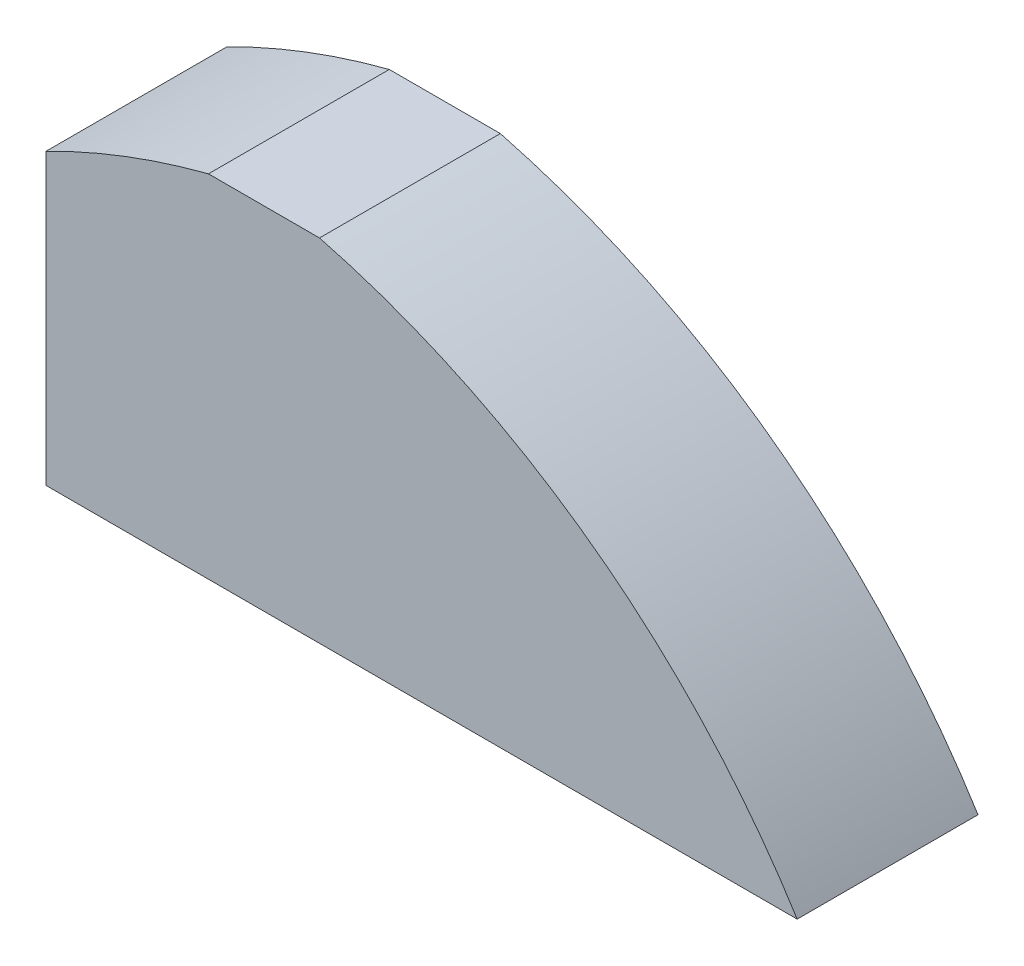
ISO-10303-21;
HEADER;
FILE_DESCRIPTION(('STEP AP214'),'2;1');
FILE_NAME('part.step','',(''),(''),'','','');
FILE_SCHEMA(('AUTOMOTIVE_DESIGN { 1 0 10303 214 1 1 1 1 }'));
ENDSEC;
DATA;
#1=APPLICATION_CONTEXT('core data for automotive mechanical design processes');
#2=APPLICATION_PROTOCOL_DEFINITION('international standard','automotive_design',2000,#1);
#3=PRODUCT_CONTEXT('',#1,'mechanical');
#4=PRODUCT('Part','Part','',(#3));
#5=PRODUCT_RELATED_PRODUCT_CATEGORY('part','',(#4));
#6=PRODUCT_DEFINITION_FORMATION('','',#4);
#7=PRODUCT_DEFINITION_CONTEXT('part definition',#1,'design');
#8=PRODUCT_DEFINITION('design','',#6,#7);
#9=PRODUCT_DEFINITION_SHAPE('','',#8);
#10=(LENGTH_UNIT() NAMED_UNIT(*) SI_UNIT(.MILLI.,.METRE.));
#11=(NAMED_UNIT(*) PLANE_ANGLE_UNIT() SI_UNIT($,.RADIAN.));
#12=(NAMED_UNIT(*) SI_UNIT($,.STERADIAN.) SOLID_ANGLE_UNIT());
#13=UNCERTAINTY_MEASURE_WITH_UNIT(LENGTH_MEASURE(1.E-05),#10,'distance_accuracy_value','');
#14=(GEOMETRIC_REPRESENTATION_CONTEXT(3) GLOBAL_UNCERTAINTY_ASSIGNED_CONTEXT((#13)) GLOBAL_UNIT_ASSIGNED_CONTEXT((#10,
#11,#12)) REPRESENTATION_CONTEXT('',''));
#15=CARTESIAN_POINT('',(0.,0.,0.));
#16=DIRECTION('',(0.,0.,1.));
#17=DIRECTION('',(1.,0.,0.));
#18=AXIS2_PLACEMENT_3D('',#15,#16,#17);
#19=CARTESIAN_POINT('',(0.,358.201119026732,500.));
#20=DIRECTION('',(0.,1.,0.));
#21=DIRECTION('',(0.,0.,1.));
#22=AXIS2_PLACEMENT_3D('',#19,#20,#21);
#23=PLANE('',#22);
#24=DIRECTION('',(1.,0.,0.));
#25=VECTOR('',#24,1.);
#26=CARTESIAN_POINT('',(0.,358.201119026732,0.));
#27=LINE('',#26,#25);
#28=CARTESIAN_POINT('',(-1262.01747886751,358.201119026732,0.));
#29=VERTEX_POINT('',#28);
#30=CARTESIAN_POINT('',(877.522557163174,358.201119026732,0.));
#31=VERTEX_POINT('',#30);
#32=EDGE_CURVE('E185',#29,#31,#27,.T.);
#33=ORIENTED_EDGE('',*,*,#32,.T.);
#34=DIRECTION('',(0.,0.,-1.));
#35=VECTOR('',#34,1.);
#36=CARTESIAN_POINT('',(877.522557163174,358.201119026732,500.));
#37=LINE('',#36,#35);
#38=CARTESIAN_POINT('',(877.522557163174,358.201119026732,515.));
#39=VERTEX_POINT('',#38);
#40=EDGE_CURVE('E11',#39,#31,#37,.T.);
#41=ORIENTED_EDGE('',*,*,#40,.F.);
#42=DIRECTION('',(1.,0.,0.));
#43=VECTOR('',#42,1.);
#44=CARTESIAN_POINT('',(-1262.01747886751,358.201119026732,515.));
#45=LINE('',#44,#43);
#46=CARTESIAN_POINT('',(-1262.01747886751,358.201119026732,515.));
#47=VERTEX_POINT('',#46);
#48=EDGE_CURVE('E251',#47,#39,#45,.T.);
#49=ORIENTED_EDGE('',*,*,#48,.F.);
#50=DIRECTION('',(0.,0.,-1.));
#51=VECTOR('',#50,1.);
#52=CARTESIAN_POINT('',(-1262.01747886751,358.201119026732,500.));
#53=LINE('',#52,#51);
#54=EDGE_CURVE('E108',#47,#29,#53,.T.);
#55=ORIENTED_EDGE('',*,*,#54,.T.);
#56=EDGE_LOOP('',(#33,#41,#49,#55));
#57=FACE_BOUND('',#56,.T.);
#58=ADVANCED_FACE('F32',(#57),#23,.F.);
#59=CARTESIAN_POINT('',(-1054.68362564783,-845.082221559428,500.));
#60=DIRECTION('',(0.,0.,-1.));
#61=DIRECTION('',(-1.,0.,0.));
#62=AXIS2_PLACEMENT_3D('',#59,#60,#61);
#63=CYLINDRICAL_SURFACE('',#62,2276.24944384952);
#64=CARTESIAN_POINT('',(-1054.68362564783,-845.082221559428,0.));
#65=DIRECTION('',(0.,0.,1.));
#66=DIRECTION('',(1.,0.,0.));
#67=AXIS2_PLACEMENT_3D('',#64,#65,#66);
#68=CIRCLE('',#67,2276.24944384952);
#69=CARTESIAN_POINT('',(-482.972114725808,1358.20111902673,0.));
#70=VERTEX_POINT('',#69);
#71=EDGE_CURVE('E187',#31,#70,#68,.T.);
#72=ORIENTED_EDGE('',*,*,#71,.T.);
#73=DIRECTION('',(0.,0.,-1.));
#74=VECTOR('',#73,1.);
#75=CARTESIAN_POINT('',(-482.972114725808,1358.20111902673,500.));
#76=LINE('',#75,#74);
#77=CARTESIAN_POINT('',(-482.972114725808,1358.20111902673,515.));
#78=VERTEX_POINT('',#77);
#79=EDGE_CURVE('E42',#78,#70,#76,.T.);
#80=ORIENTED_EDGE('',*,*,#79,.F.);
#81=CARTESIAN_POINT('',(-1054.68362564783,-845.082221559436,515.));
#82=DIRECTION('',(0.,0.,1.));
#83=DIRECTION('',(-1.,0.,0.));
#84=AXIS2_PLACEMENT_3D('',#81,#82,#83);
#85=CIRCLE('',#84,2276.24944384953);
#86=EDGE_CURVE('E248',#39,#78,#85,.T.);
#87=ORIENTED_EDGE('',*,*,#86,.F.);
#88=ORIENTED_EDGE('',*,*,#40,.T.);
#89=EDGE_LOOP('',(#72,#80,#87,#88));
#90=FACE_BOUND('',#89,.T.);
#91=ADVANCED_FACE('F285',(#90),#63,.T.);
#92=CARTESIAN_POINT('',(0.,1358.20111902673,500.));
#93=DIRECTION('',(0.,1.,0.));
#94=DIRECTION('',(0.,0.,1.));
#95=AXIS2_PLACEMENT_3D('',#92,#93,#94);
#96=PLANE('',#95);
#97=DIRECTION('',(1.,0.,0.));
#98=VECTOR('',#97,1.);
#99=CARTESIAN_POINT('',(0.,1358.20111902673,0.));
#100=LINE('',#99,#98);
#101=CARTESIAN_POINT('',(-799.271194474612,1358.20111902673,0.));
#102=VERTEX_POINT('',#101);
#103=EDGE_CURVE('E190',#102,#70,#100,.T.);
#104=ORIENTED_EDGE('',*,*,#103,.F.);
#105=DIRECTION('',(0.,0.,-1.));
#106=VECTOR('',#105,1.);
#107=CARTESIAN_POINT('',(-799.271194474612,1358.20111902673,500.));
#108=LINE('',#107,#106);
#109=CARTESIAN_POINT('',(-799.271194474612,1358.20111902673,515.));
#110=VERTEX_POINT('',#109);
#111=EDGE_CURVE('E202',#110,#102,#108,.T.);
#112=ORIENTED_EDGE('',*,*,#111,.F.);
#113=DIRECTION('',(-1.,0.,0.));
#114=VECTOR('',#113,1.);
#115=CARTESIAN_POINT('',(-799.271194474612,1358.20111902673,515.));
#116=LINE('',#115,#114);
#117=EDGE_CURVE('E166',#78,#110,#116,.T.);
#118=ORIENTED_EDGE('',*,*,#117,.F.);
#119=ORIENTED_EDGE('',*,*,#79,.T.);
#120=EDGE_LOOP('',(#104,#112,#118,#119));
#121=FACE_BOUND('',#120,.T.);
#122=ADVANCED_FACE('F286',(#121),#96,.T.);
#123=CARTESIAN_POINT('',(-227.559683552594,-845.082221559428,500.));
#124=DIRECTION('',(0.,0.,-1.));
#125=DIRECTION('',(-1.,0.,0.));
#126=AXIS2_PLACEMENT_3D('',#123,#124,#125);
#127=CYLINDRICAL_SURFACE('',#126,2276.24944384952);
#128=CARTESIAN_POINT('',(-227.559683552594,-845.082221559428,0.));
#129=DIRECTION('',(0.,0.,1.));
#130=DIRECTION('',(1.,0.,0.));
#131=AXIS2_PLACEMENT_3D('',#128,#129,#130);
#132=CIRCLE('',#131,2276.24944384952);
#133=CARTESIAN_POINT('',(-1262.01747886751,1182.52932909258,0.));
#134=VERTEX_POINT('',#133);
#135=EDGE_CURVE('E193',#134,#102,#132,.F.);
#136=ORIENTED_EDGE('',*,*,#135,.F.);
#137=DIRECTION('',(0.,0.,-1.));
#138=VECTOR('',#137,1.);
#139=CARTESIAN_POINT('',(-1262.01747886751,1182.52932909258,500.));
#140=LINE('',#139,#138);
#141=CARTESIAN_POINT('',(-1262.01747886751,1182.52932909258,515.));
#142=VERTEX_POINT('',#141);
#143=EDGE_CURVE('E100',#142,#134,#140,.T.);
#144=ORIENTED_EDGE('',*,*,#143,.F.);
#145=CARTESIAN_POINT('',(-227.559683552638,-845.082221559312,515.));
#146=DIRECTION('',(0.,0.,1.));
#147=DIRECTION('',(-1.,0.,0.));
#148=AXIS2_PLACEMENT_3D('',#145,#146,#147);
#149=CIRCLE('',#148,2276.2494438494);
#150=EDGE_CURVE('E257',#110,#142,#149,.T.);
#151=ORIENTED_EDGE('',*,*,#150,.F.);
#152=ORIENTED_EDGE('',*,*,#111,.T.);
#153=EDGE_LOOP('',(#136,#144,#151,#152));
#154=FACE_BOUND('',#153,.T.);
#155=ADVANCED_FACE('F268',(#154),#127,.T.);
#156=CARTESIAN_POINT('',(-1054.68362564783,-845.082221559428,500.));
#157=DIRECTION('',(0.,0.,-1.));
#158=DIRECTION('',(-1.,0.,0.));
#159=AXIS2_PLACEMENT_3D('',#156,#157,#158);
#160=CYLINDRICAL_SURFACE('',#159,2246.24944384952);
#161=CARTESIAN_POINT('',(-1054.68362564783,-845.082221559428,0.));
#162=DIRECTION('',(0.,0.,1.));
#163=DIRECTION('',(1.,0.,0.));
#164=AXIS2_PLACEMENT_3D('',#161,#162,#163);
#165=CIRCLE('',#164,2246.24944384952);
#166=CARTESIAN_POINT('',(822.721169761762,388.201119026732,0.));
#167=VERTEX_POINT('',#166);
#168=CARTESIAN_POINT('',(426.982978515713,843.201119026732,0.));
#169=VERTEX_POINT('',#168);
#170=EDGE_CURVE('E137',#167,#169,#165,.T.);
#171=ORIENTED_EDGE('',*,*,#170,.F.);
#172=DIRECTION('',(0.,0.,-1.));
#173=VECTOR('',#172,1.);
#174=CARTESIAN_POINT('',(822.721169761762,388.201119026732,500.));
#175=LINE('',#174,#173);
#176=CARTESIAN_POINT('',(822.721169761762,388.201119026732,500.));
#177=VERTEX_POINT('',#176);
#178=EDGE_CURVE('E131',#177,#167,#175,.T.);
#179=ORIENTED_EDGE('',*,*,#178,.F.);
#180=CARTESIAN_POINT('',(-1054.68362564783,-845.082221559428,500.));
#181=DIRECTION('',(0.,0.,1.));
#182=DIRECTION('',(1.,0.,0.));
#183=AXIS2_PLACEMENT_3D('',#180,#181,#182);
#184=CIRCLE('',#183,2246.24944384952);
#185=CARTESIAN_POINT('',(426.982978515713,843.201119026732,500.));
#186=VERTEX_POINT('',#185);
#187=EDGE_CURVE('E135',#177,#186,#184,.T.);
#188=ORIENTED_EDGE('',*,*,#187,.T.);
#189=DIRECTION('',(0.,0.,-1.));
#190=VECTOR('',#189,1.);
#191=CARTESIAN_POINT('',(426.982978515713,843.201119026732,500.));
#192=LINE('',#191,#190);
#193=EDGE_CURVE('E205',#186,#169,#192,.T.);
#194=ORIENTED_EDGE('',*,*,#193,.T.);
#195=EDGE_LOOP('',(#171,#179,#188,#194));
#196=FACE_BOUND('',#195,.T.);
#197=ADVANCED_FACE('F133',(#196),#160,.F.);
#198=CARTESIAN_POINT('',(0.,388.201119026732,500.));
#199=DIRECTION('',(0.,1.,0.));
#200=DIRECTION('',(0.,0.,1.));
#201=AXIS2_PLACEMENT_3D('',#198,#199,#200);
#202=PLANE('',#201);
#203=DIRECTION('',(1.,0.,0.));
#204=VECTOR('',#203,1.);
#205=CARTESIAN_POINT('',(0.,388.201119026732,0.));
#206=LINE('',#205,#204);
#207=CARTESIAN_POINT('',(-1232.01747886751,388.201119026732,0.));
#208=VERTEX_POINT('',#207);
#209=EDGE_CURVE('E177',#208,#167,#206,.T.);
#210=ORIENTED_EDGE('',*,*,#209,.F.);
#211=DIRECTION('',(0.,0.,-1.));
#212=VECTOR('',#211,1.);
#213=CARTESIAN_POINT('',(-1232.01747886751,388.201119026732,500.));
#214=LINE('',#213,#212);
#215=CARTESIAN_POINT('',(-1232.01747886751,388.201119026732,500.));
#216=VERTEX_POINT('',#215);
#217=EDGE_CURVE('E141',#216,#208,#214,.T.);
#218=ORIENTED_EDGE('',*,*,#217,.F.);
#219=DIRECTION('',(1.,0.,0.));
#220=VECTOR('',#219,1.);
#221=CARTESIAN_POINT('',(0.,388.201119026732,500.));
#222=LINE('',#221,#220);
#223=EDGE_CURVE('E144',#216,#177,#222,.T.);
#224=ORIENTED_EDGE('',*,*,#223,.T.);
#225=ORIENTED_EDGE('',*,*,#178,.T.);
#226=EDGE_LOOP('',(#210,#218,#224,#225));
#227=FACE_BOUND('',#226,.T.);
#228=ADVANCED_FACE('F145',(#227),#202,.T.);
#229=CARTESIAN_POINT('',(-1232.01747886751,0.,500.));
#230=DIRECTION('',(-1.,0.,0.));
#231=DIRECTION('',(0.,0.,1.));
#232=AXIS2_PLACEMENT_3D('',#229,#230,#231);
#233=PLANE('',#232);
#234=DIRECTION('',(0.,1.,0.));
#235=VECTOR('',#234,1.);
#236=CARTESIAN_POINT('',(-1232.01747886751,0.,0.));
#237=LINE('',#236,#235);
#238=CARTESIAN_POINT('',(-1232.01747886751,843.201119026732,0.));
#239=VERTEX_POINT('',#238);
#240=EDGE_CURVE('E179',#208,#239,#237,.T.);
#241=ORIENTED_EDGE('',*,*,#240,.T.);
#242=DIRECTION('',(0.,0.,-1.));
#243=VECTOR('',#242,1.);
#244=CARTESIAN_POINT('',(-1232.01747886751,843.201119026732,500.));
#245=LINE('',#244,#243);
#246=CARTESIAN_POINT('',(-1232.01747886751,843.201119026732,500.));
#247=VERTEX_POINT('',#246);
#248=EDGE_CURVE('E207',#247,#239,#245,.T.);
#249=ORIENTED_EDGE('',*,*,#248,.F.);
#250=DIRECTION('',(0.,1.,0.));
#251=VECTOR('',#250,1.);
#252=CARTESIAN_POINT('',(-1232.01747886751,0.,500.));
#253=LINE('',#252,#251);
#254=EDGE_CURVE('E149',#216,#247,#253,.T.);
#255=ORIENTED_EDGE('',*,*,#254,.F.);
#256=ORIENTED_EDGE('',*,*,#217,.T.);
#257=EDGE_LOOP('',(#241,#249,#255,#256));
#258=FACE_BOUND('',#257,.T.);
#259=ADVANCED_FACE('F304',(#258),#233,.F.);
#260=CARTESIAN_POINT('',(-1054.68362564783,-845.082221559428,500.));
#261=DIRECTION('',(0.,0.,-1.));
#262=DIRECTION('',(-1.,0.,0.));
#263=AXIS2_PLACEMENT_3D('',#260,#261,#262);
#264=CYLINDRICAL_SURFACE('',#263,2246.24944384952);
#265=CARTESIAN_POINT('',(-1054.68362564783,-845.082221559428,0.));
#266=DIRECTION('',(0.,0.,1.));
#267=DIRECTION('',(1.,0.,0.));
#268=AXIS2_PLACEMENT_3D('',#265,#266,#267);
#269=CIRCLE('',#268,2246.24944384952);
#270=CARTESIAN_POINT('',(392.084816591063,873.201119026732,0.));
#271=VERTEX_POINT('',#270);
#272=CARTESIAN_POINT('',(-486.813846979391,1328.20111902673,0.));
#273=VERTEX_POINT('',#272);
#274=EDGE_CURVE('E162',#271,#273,#269,.T.);
#275=ORIENTED_EDGE('',*,*,#274,.F.);
#276=DIRECTION('',(0.,0.,-1.));
#277=VECTOR('',#276,1.);
#278=CARTESIAN_POINT('',(392.084816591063,873.201119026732,500.));
#279=LINE('',#278,#277);
#280=CARTESIAN_POINT('',(392.084816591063,873.201119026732,500.));
#281=VERTEX_POINT('',#280);
#282=EDGE_CURVE('E36',#281,#271,#279,.T.);
#283=ORIENTED_EDGE('',*,*,#282,.F.);
#284=CARTESIAN_POINT('',(-1054.68362564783,-845.082221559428,500.));
#285=DIRECTION('',(0.,0.,1.));
#286=DIRECTION('',(1.,0.,0.));
#287=AXIS2_PLACEMENT_3D('',#284,#285,#286);
#288=CIRCLE('',#287,2246.24944384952);
#289=CARTESIAN_POINT('',(-486.813846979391,1328.20111902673,500.));
#290=VERTEX_POINT('',#289);
#291=EDGE_CURVE('E199',#281,#290,#288,.T.);
#292=ORIENTED_EDGE('',*,*,#291,.T.);
#293=DIRECTION('',(0.,0.,-1.));
#294=VECTOR('',#293,1.);
#295=CARTESIAN_POINT('',(-486.813846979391,1328.20111902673,500.));
#296=LINE('',#295,#294);
#297=EDGE_CURVE('E161',#290,#273,#296,.T.);
#298=ORIENTED_EDGE('',*,*,#297,.T.);
#299=EDGE_LOOP('',(#275,#283,#292,#298));
#300=FACE_BOUND('',#299,.T.);
#301=ADVANCED_FACE('F34',(#300),#264,.F.);
#302=CARTESIAN_POINT('',(0.,873.201119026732,500.));
#303=DIRECTION('',(0.,1.,0.));
#304=DIRECTION('',(0.,0.,1.));
#305=AXIS2_PLACEMENT_3D('',#302,#303,#304);
#306=PLANE('',#305);
#307=DIRECTION('',(1.,0.,0.));
#308=VECTOR('',#307,1.);
#309=CARTESIAN_POINT('',(0.,873.201119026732,0.));
#310=LINE('',#309,#308);
#311=CARTESIAN_POINT('',(-1232.01747886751,873.201119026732,0.));
#312=VERTEX_POINT('',#311);
#313=EDGE_CURVE('E165',#312,#271,#310,.T.);
#314=ORIENTED_EDGE('',*,*,#313,.F.);
#315=DIRECTION('',(0.,0.,-1.));
#316=VECTOR('',#315,1.);
#317=CARTESIAN_POINT('',(-1232.01747886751,873.201119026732,500.));
#318=LINE('',#317,#316);
#319=CARTESIAN_POINT('',(-1232.01747886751,873.201119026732,500.));
#320=VERTEX_POINT('',#319);
#321=EDGE_CURVE('E216',#320,#312,#318,.T.);
#322=ORIENTED_EDGE('',*,*,#321,.F.);
#323=DIRECTION('',(1.,0.,0.));
#324=VECTOR('',#323,1.);
#325=CARTESIAN_POINT('',(0.,873.201119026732,500.));
#326=LINE('',#325,#324);
#327=EDGE_CURVE('E224',#320,#281,#326,.T.);
#328=ORIENTED_EDGE('',*,*,#327,.T.);
#329=ORIENTED_EDGE('',*,*,#282,.T.);
#330=EDGE_LOOP('',(#314,#322,#328,#329));
#331=FACE_BOUND('',#330,.T.);
#332=ADVANCED_FACE('F222',(#331),#306,.T.);
#333=CARTESIAN_POINT('',(-1232.01747886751,0.,500.));
#334=DIRECTION('',(-1.,0.,0.));
#335=DIRECTION('',(0.,0.,1.));
#336=AXIS2_PLACEMENT_3D('',#333,#334,#335);
#337=PLANE('',#336);
#338=DIRECTION('',(0.,1.,0.));
#339=VECTOR('',#338,1.);
#340=CARTESIAN_POINT('',(-1232.01747886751,0.,0.));
#341=LINE('',#340,#339);
#342=CARTESIAN_POINT('',(-1232.01747886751,1164.07210338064,0.));
#343=VERTEX_POINT('',#342);
#344=EDGE_CURVE('E169',#312,#343,#341,.T.);
#345=ORIENTED_EDGE('',*,*,#344,.T.);
#346=DIRECTION('',(0.,0.,-1.));
#347=VECTOR('',#346,1.);
#348=CARTESIAN_POINT('',(-1232.01747886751,1164.07210338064,500.));
#349=LINE('',#348,#347);
#350=CARTESIAN_POINT('',(-1232.01747886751,1164.07210338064,500.));
#351=VERTEX_POINT('',#350);
#352=EDGE_CURVE('E214',#351,#343,#349,.T.);
#353=ORIENTED_EDGE('',*,*,#352,.F.);
#354=DIRECTION('',(0.,1.,0.));
#355=VECTOR('',#354,1.);
#356=CARTESIAN_POINT('',(-1232.01747886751,0.,500.));
#357=LINE('',#356,#355);
#358=EDGE_CURVE('E240',#320,#351,#357,.T.);
#359=ORIENTED_EDGE('',*,*,#358,.F.);
#360=ORIENTED_EDGE('',*,*,#321,.T.);
#361=EDGE_LOOP('',(#345,#353,#359,#360));
#362=FACE_BOUND('',#361,.T.);
#363=ADVANCED_FACE('F232',(#362),#337,.F.);
#364=CARTESIAN_POINT('',(-227.559683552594,-845.082221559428,500.));
#365=DIRECTION('',(0.,0.,-1.));
#366=DIRECTION('',(-1.,0.,0.));
#367=AXIS2_PLACEMENT_3D('',#364,#365,#366);
#368=CYLINDRICAL_SURFACE('',#367,2246.24944384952);
#369=CARTESIAN_POINT('',(-227.559683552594,-845.082221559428,0.));
#370=DIRECTION('',(0.,0.,1.));
#371=DIRECTION('',(1.,0.,0.));
#372=AXIS2_PLACEMENT_3D('',#369,#370,#371);
#373=CIRCLE('',#372,2246.24944384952);
#374=CARTESIAN_POINT('',(-795.429462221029,1328.20111902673,0.));
#375=VERTEX_POINT('',#374);
#376=EDGE_CURVE('E171',#343,#375,#373,.F.);
#377=ORIENTED_EDGE('',*,*,#376,.T.);
#378=DIRECTION('',(0.,0.,-1.));
#379=VECTOR('',#378,1.);
#380=CARTESIAN_POINT('',(-795.429462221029,1328.20111902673,500.));
#381=LINE('',#380,#379);
#382=CARTESIAN_POINT('',(-795.429462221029,1328.20111902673,500.));
#383=VERTEX_POINT('',#382);
#384=EDGE_CURVE('E211',#383,#375,#381,.T.);
#385=ORIENTED_EDGE('',*,*,#384,.F.);
#386=CARTESIAN_POINT('',(-227.559683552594,-845.082221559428,500.));
#387=DIRECTION('',(0.,0.,1.));
#388=DIRECTION('',(1.,0.,0.));
#389=AXIS2_PLACEMENT_3D('',#386,#387,#388);
#390=CIRCLE('',#389,2246.24944384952);
#391=EDGE_CURVE('E155',#351,#383,#390,.F.);
#392=ORIENTED_EDGE('',*,*,#391,.F.);
#393=ORIENTED_EDGE('',*,*,#352,.T.);
#394=EDGE_LOOP('',(#377,#385,#392,#393));
#395=FACE_BOUND('',#394,.T.);
#396=ADVANCED_FACE('F235',(#395),#368,.F.);
#397=CARTESIAN_POINT('',(0.,843.201119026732,500.));
#398=DIRECTION('',(0.,1.,0.));
#399=DIRECTION('',(-1.,0.,0.));
#400=AXIS2_PLACEMENT_3D('',#397,#398,#399);
#401=PLANE('',#400);
#402=DIRECTION('',(1.,0.,0.));
#403=VECTOR('',#402,1.);
#404=CARTESIAN_POINT('',(0.,843.201119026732,0.));
#405=LINE('',#404,#403);
#406=EDGE_CURVE('E182',#239,#169,#405,.T.);
#407=ORIENTED_EDGE('',*,*,#406,.T.);
#408=ORIENTED_EDGE('',*,*,#193,.F.);
#409=DIRECTION('',(1.,0.,0.));
#410=VECTOR('',#409,1.);
#411=CARTESIAN_POINT('',(0.,843.201119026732,500.));
#412=LINE('',#411,#410);
#413=EDGE_CURVE('E51',#247,#186,#412,.T.);
#414=ORIENTED_EDGE('',*,*,#413,.F.);
#415=ORIENTED_EDGE('',*,*,#248,.T.);
#416=EDGE_LOOP('',(#407,#408,#414,#415));
#417=FACE_BOUND('',#416,.T.);
#418=ADVANCED_FACE('F300',(#417),#401,.F.);
#419=CARTESIAN_POINT('',(0.,1328.20111902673,500.));
#420=DIRECTION('',(0.,1.,0.));
#421=DIRECTION('',(0.,0.,1.));
#422=AXIS2_PLACEMENT_3D('',#419,#420,#421);
#423=PLANE('',#422);
#424=DIRECTION('',(1.,0.,0.));
#425=VECTOR('',#424,1.);
#426=CARTESIAN_POINT('',(0.,1328.20111902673,0.));
#427=LINE('',#426,#425);
#428=EDGE_CURVE('E173',#375,#273,#427,.T.);
#429=ORIENTED_EDGE('',*,*,#428,.T.);
#430=ORIENTED_EDGE('',*,*,#297,.F.);
#431=DIRECTION('',(1.,0.,0.));
#432=VECTOR('',#431,1.);
#433=CARTESIAN_POINT('',(0.,1328.20111902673,500.));
#434=LINE('',#433,#432);
#435=EDGE_CURVE('E152',#383,#290,#434,.T.);
#436=ORIENTED_EDGE('',*,*,#435,.F.);
#437=ORIENTED_EDGE('',*,*,#384,.T.);
#438=EDGE_LOOP('',(#429,#430,#436,#437));
#439=FACE_BOUND('',#438,.T.);
#440=ADVANCED_FACE('F303',(#439),#423,.F.);
#441=CARTESIAN_POINT('',(-1262.01747886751,0.,500.));
#442=DIRECTION('',(-1.,0.,0.));
#443=DIRECTION('',(0.,0.,1.));
#444=AXIS2_PLACEMENT_3D('',#441,#442,#443);
#445=PLANE('',#444);
#446=DIRECTION('',(0.,1.,0.));
#447=VECTOR('',#446,1.);
#448=CARTESIAN_POINT('',(-1262.01747886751,0.,0.));
#449=LINE('',#448,#447);
#450=EDGE_CURVE('E196',#29,#134,#449,.T.);
#451=ORIENTED_EDGE('',*,*,#450,.F.);
#452=ORIENTED_EDGE('',*,*,#54,.F.);
#453=DIRECTION('',(0.,-1.,0.));
#454=VECTOR('',#453,1.);
#455=CARTESIAN_POINT('',(-1262.01747886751,1182.52932909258,515.));
#456=LINE('',#455,#454);
#457=EDGE_CURVE('E254',#142,#47,#456,.T.);
#458=ORIENTED_EDGE('',*,*,#457,.F.);
#459=ORIENTED_EDGE('',*,*,#143,.T.);
#460=EDGE_LOOP('',(#451,#452,#458,#459));
#461=FACE_BOUND('',#460,.T.);
#462=ADVANCED_FACE('F281',(#461),#445,.T.);
#463=CARTESIAN_POINT('',(0.,0.,0.));
#464=DIRECTION('',(0.,0.,1.));
#465=DIRECTION('',(1.,0.,0.));
#466=AXIS2_PLACEMENT_3D('',#463,#464,#465);
#467=PLANE('',#466);
#468=ORIENTED_EDGE('',*,*,#274,.T.);
#469=ORIENTED_EDGE('',*,*,#428,.F.);
#470=ORIENTED_EDGE('',*,*,#376,.F.);
#471=ORIENTED_EDGE('',*,*,#344,.F.);
#472=ORIENTED_EDGE('',*,*,#313,.T.);
#473=EDGE_LOOP('',(#468,#469,#470,#471,#472));
#474=FACE_BOUND('',#473,.T.);
#475=ORIENTED_EDGE('',*,*,#170,.T.);
#476=ORIENTED_EDGE('',*,*,#406,.F.);
#477=ORIENTED_EDGE('',*,*,#240,.F.);
#478=ORIENTED_EDGE('',*,*,#209,.T.);
#479=EDGE_LOOP('',(#475,#476,#477,#478));
#480=FACE_BOUND('',#479,.T.);
#481=ORIENTED_EDGE('',*,*,#32,.F.);
#482=ORIENTED_EDGE('',*,*,#450,.T.);
#483=ORIENTED_EDGE('',*,*,#135,.T.);
#484=ORIENTED_EDGE('',*,*,#103,.T.);
#485=ORIENTED_EDGE('',*,*,#71,.F.);
#486=EDGE_LOOP('',(#481,#482,#483,#484,#485));
#487=FACE_BOUND('',#486,.T.);
#488=ADVANCED_FACE('F229',(#474,#480,#487),#467,.F.);
#489=CARTESIAN_POINT('',(-227.559683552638,-845.082221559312,515.));
#490=DIRECTION('',(0.,0.,-1.));
#491=DIRECTION('',(-1.,0.,0.));
#492=AXIS2_PLACEMENT_3D('',#489,#490,#491);
#493=PLANE('',#492);
#494=ORIENTED_EDGE('',*,*,#150,.T.);
#495=ORIENTED_EDGE('',*,*,#457,.T.);
#496=ORIENTED_EDGE('',*,*,#48,.T.);
#497=ORIENTED_EDGE('',*,*,#86,.T.);
#498=ORIENTED_EDGE('',*,*,#117,.T.);
#499=EDGE_LOOP('',(#494,#495,#496,#497,#498));
#500=FACE_BOUND('',#499,.T.);
#501=ADVANCED_FACE('F262',(#500),#493,.F.);
#502=CARTESIAN_POINT('',(-227.559683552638,-845.082221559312,500.));
#503=DIRECTION('',(0.,0.,-1.));
#504=DIRECTION('',(-1.,0.,0.));
#505=AXIS2_PLACEMENT_3D('',#502,#503,#504);
#506=PLANE('',#505);
#507=ORIENTED_EDGE('',*,*,#435,.T.);
#508=ORIENTED_EDGE('',*,*,#291,.F.);
#509=ORIENTED_EDGE('',*,*,#327,.F.);
#510=ORIENTED_EDGE('',*,*,#358,.T.);
#511=ORIENTED_EDGE('',*,*,#391,.T.);
#512=EDGE_LOOP('',(#507,#508,#509,#510,#511));
#513=FACE_BOUND('',#512,.T.);
#514=ADVANCED_FACE('F241',(#513),#506,.T.);
#515=ORIENTED_EDGE('',*,*,#413,.T.);
#516=ORIENTED_EDGE('',*,*,#187,.F.);
#517=ORIENTED_EDGE('',*,*,#223,.F.);
#518=ORIENTED_EDGE('',*,*,#254,.T.);
#519=EDGE_LOOP('',(#515,#516,#517,#518));
#520=FACE_BOUND('',#519,.T.);
#521=ADVANCED_FACE('F151',(#520),#506,.T.);
#522=CLOSED_SHELL('',(#58,#91,#122,#155,#197,#228,#259,#301,#332,#363,#396,#418,#440,#462,#488,
#501,#514,#521));
#523=MANIFOLD_SOLID_BREP('B2',#522);
#524=ADVANCED_BREP_SHAPE_REPRESENTATION('',(#18,#523),#14);
#525=SHAPE_DEFINITION_REPRESENTATION(#9,#524);
ENDSEC;
END-ISO-10303-21;
